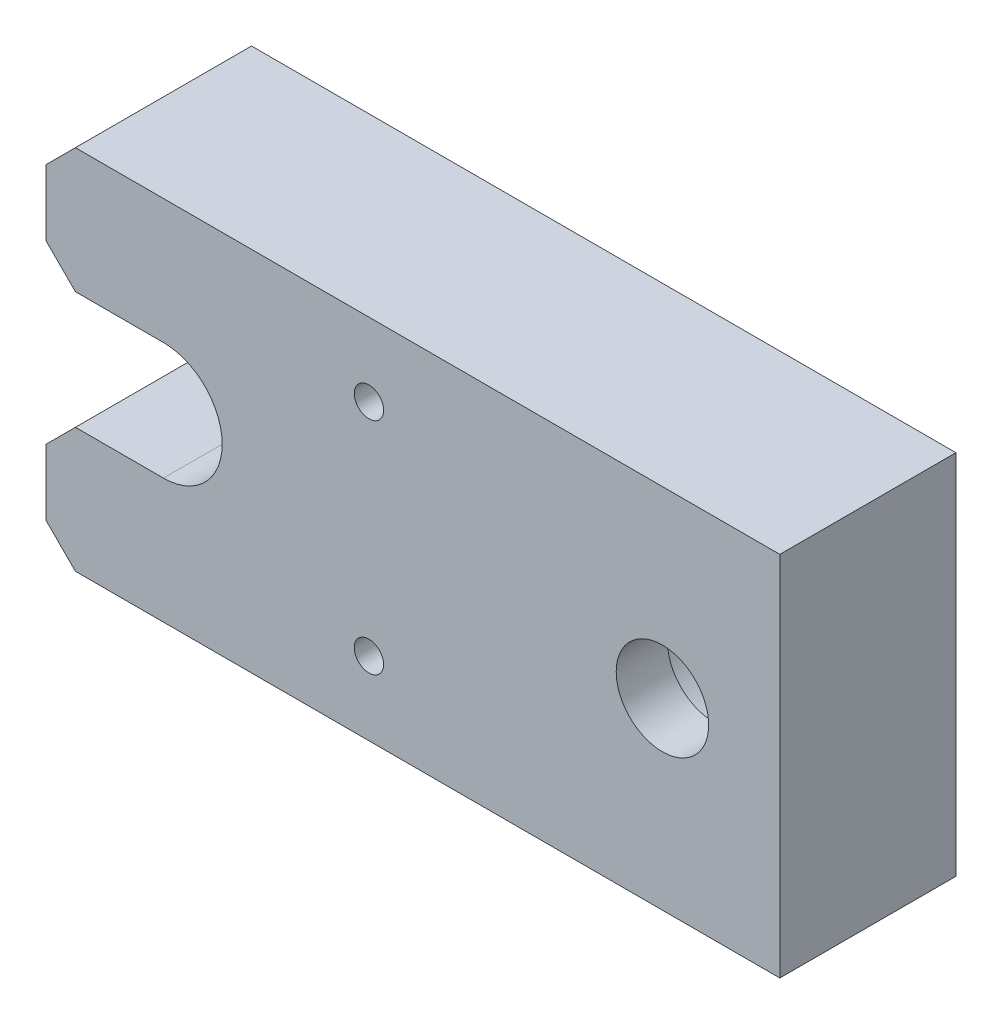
ISO-10303-21;
HEADER;
FILE_DESCRIPTION(('STEP AP214'),'2;1');
FILE_NAME('part.step','',(''),(''),'','','');
FILE_SCHEMA(('AUTOMOTIVE_DESIGN { 1 0 10303 214 1 1 1 1 }'));
ENDSEC;
DATA;
#1=APPLICATION_CONTEXT('core data for automotive mechanical design processes');
#2=APPLICATION_PROTOCOL_DEFINITION('international standard','automotive_design',2000,#1);
#3=PRODUCT_CONTEXT('',#1,'mechanical');
#4=PRODUCT('Part','Part','',(#3));
#5=PRODUCT_RELATED_PRODUCT_CATEGORY('part','',(#4));
#6=PRODUCT_DEFINITION_FORMATION('','',#4);
#7=PRODUCT_DEFINITION_CONTEXT('part definition',#1,'design');
#8=PRODUCT_DEFINITION('design','',#6,#7);
#9=PRODUCT_DEFINITION_SHAPE('','',#8);
#10=(LENGTH_UNIT() NAMED_UNIT(*) SI_UNIT(.MILLI.,.METRE.));
#11=(NAMED_UNIT(*) PLANE_ANGLE_UNIT() SI_UNIT($,.RADIAN.));
#12=(NAMED_UNIT(*) SI_UNIT($,.STERADIAN.) SOLID_ANGLE_UNIT());
#13=UNCERTAINTY_MEASURE_WITH_UNIT(LENGTH_MEASURE(1.E-05),#10,'distance_accuracy_value','');
#14=(GEOMETRIC_REPRESENTATION_CONTEXT(3) GLOBAL_UNCERTAINTY_ASSIGNED_CONTEXT((#13)) GLOBAL_UNIT_ASSIGNED_CONTEXT((#10,
#11,#12)) REPRESENTATION_CONTEXT('',''));
#15=CARTESIAN_POINT('',(0.,0.,0.));
#16=DIRECTION('',(0.,0.,1.));
#17=DIRECTION('',(1.,0.,0.));
#18=AXIS2_PLACEMENT_3D('',#15,#16,#17);
#19=CARTESIAN_POINT('',(-6.00000000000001,12.5,0.));
#20=DIRECTION('',(0.,0.,1.));
#21=DIRECTION('',(1.,0.,0.));
#22=AXIS2_PLACEMENT_3D('',#19,#20,#21);
#23=PLANE('',#22);
#24=CARTESIAN_POINT('',(8.,5.,0.));
#25=DIRECTION('',(0.,0.,1.));
#26=DIRECTION('',(1.,0.,0.));
#27=AXIS2_PLACEMENT_3D('',#24,#25,#26);
#28=CIRCLE('',#27,2.5);
#29=CARTESIAN_POINT('',(5.5,5.,0.));
#30=VERTEX_POINT('',#29);
#31=EDGE_CURVE('E236',#30,#30,#28,.T.);
#32=ORIENTED_EDGE('',*,*,#31,.T.);
#33=EDGE_LOOP('',(#32));
#34=FACE_BOUND('',#33,.T.);
#35=DIRECTION('',(0.,-1.,0.));
#36=VECTOR('',#35,1.);
#37=CARTESIAN_POINT('',(-14.,0.,0.));
#38=LINE('',#37,#36);
#39=CARTESIAN_POINT('',(-14.,6.5,0.));
#40=VERTEX_POINT('',#39);
#41=CARTESIAN_POINT('',(-14.,2.00000000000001,0.));
#42=VERTEX_POINT('',#41);
#43=EDGE_CURVE('E139',#40,#42,#38,.T.);
#44=ORIENTED_EDGE('',*,*,#43,.F.);
#45=DIRECTION('',(-0.707106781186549,-0.707106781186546,0.));
#46=VECTOR('',#45,1.);
#47=CARTESIAN_POINT('',(-14.,6.5,0.));
#48=LINE('',#47,#46);
#49=CARTESIAN_POINT('',(-12.,8.5,0.));
#50=VERTEX_POINT('',#49);
#51=EDGE_CURVE('E205',#40,#50,#48,.F.);
#52=ORIENTED_EDGE('',*,*,#51,.T.);
#53=DIRECTION('',(-1.,0.,0.));
#54=VECTOR('',#53,1.);
#55=CARTESIAN_POINT('',(-14.,8.5,0.));
#56=LINE('',#55,#54);
#57=CARTESIAN_POINT('',(-6.00000000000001,8.5,0.));
#58=VERTEX_POINT('',#57);
#59=EDGE_CURVE('E184',#58,#50,#56,.T.);
#60=ORIENTED_EDGE('',*,*,#59,.F.);
#61=CARTESIAN_POINT('',(-6.00000000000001,12.5,0.));
#62=DIRECTION('',(0.,0.,-1.));
#63=DIRECTION('',(1.,0.,0.));
#64=AXIS2_PLACEMENT_3D('',#61,#62,#63);
#65=CIRCLE('',#64,4.);
#66=CARTESIAN_POINT('',(-6.00000000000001,16.5,0.));
#67=VERTEX_POINT('',#66);
#68=EDGE_CURVE('E182',#67,#58,#65,.T.);
#69=ORIENTED_EDGE('',*,*,#68,.F.);
#70=DIRECTION('',(1.,0.,0.));
#71=VECTOR('',#70,1.);
#72=CARTESIAN_POINT('',(-14.,16.5,0.));
#73=LINE('',#72,#71);
#74=CARTESIAN_POINT('',(-12.,16.5,0.));
#75=VERTEX_POINT('',#74);
#76=EDGE_CURVE('E180',#75,#67,#73,.T.);
#77=ORIENTED_EDGE('',*,*,#76,.F.);
#78=DIRECTION('',(0.707106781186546,-0.707106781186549,0.));
#79=VECTOR('',#78,1.);
#80=CARTESIAN_POINT('',(-12.,16.5,0.));
#81=LINE('',#80,#79);
#82=CARTESIAN_POINT('',(-14.,18.5,0.));
#83=VERTEX_POINT('',#82);
#84=EDGE_CURVE('E203',#75,#83,#81,.F.);
#85=ORIENTED_EDGE('',*,*,#84,.T.);
#86=DIRECTION('',(0.,-1.,0.));
#87=VECTOR('',#86,1.);
#88=CARTESIAN_POINT('',(-14.,16.5,0.));
#89=LINE('',#88,#87);
#90=CARTESIAN_POINT('',(-14.,23.,0.));
#91=VERTEX_POINT('',#90);
#92=EDGE_CURVE('E178',#91,#83,#89,.T.);
#93=ORIENTED_EDGE('',*,*,#92,.F.);
#94=DIRECTION('',(-0.707106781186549,-0.707106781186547,0.));
#95=VECTOR('',#94,1.);
#96=CARTESIAN_POINT('',(-14.,23.,0.));
#97=LINE('',#96,#95);
#98=CARTESIAN_POINT('',(-12.,25.,0.));
#99=VERTEX_POINT('',#98);
#100=EDGE_CURVE('E199',#91,#99,#97,.F.);
#101=ORIENTED_EDGE('',*,*,#100,.T.);
#102=DIRECTION('',(-1.,0.,0.));
#103=VECTOR('',#102,1.);
#104=CARTESIAN_POINT('',(0.,25.,0.));
#105=LINE('',#104,#103);
#106=CARTESIAN_POINT('',(36.,25.,0.));
#107=VERTEX_POINT('',#106);
#108=EDGE_CURVE('E175',#107,#99,#105,.T.);
#109=ORIENTED_EDGE('',*,*,#108,.F.);
#110=DIRECTION('',(0.,1.,0.));
#111=VECTOR('',#110,1.);
#112=CARTESIAN_POINT('',(36.,0.,0.));
#113=LINE('',#112,#111);
#114=CARTESIAN_POINT('',(36.,0.,0.));
#115=VERTEX_POINT('',#114);
#116=EDGE_CURVE('E172',#115,#107,#113,.T.);
#117=ORIENTED_EDGE('',*,*,#116,.F.);
#118=DIRECTION('',(1.,0.,0.));
#119=VECTOR('',#118,1.);
#120=CARTESIAN_POINT('',(0.,0.,0.));
#121=LINE('',#120,#119);
#122=CARTESIAN_POINT('',(-12.,0.,0.));
#123=VERTEX_POINT('',#122);
#124=EDGE_CURVE('E145',#123,#115,#121,.T.);
#125=ORIENTED_EDGE('',*,*,#124,.F.);
#126=DIRECTION('',(0.707106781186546,-0.707106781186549,0.));
#127=VECTOR('',#126,1.);
#128=CARTESIAN_POINT('',(-12.,0.,0.));
#129=LINE('',#128,#127);
#130=EDGE_CURVE('E201',#123,#42,#129,.F.);
#131=ORIENTED_EDGE('',*,*,#130,.T.);
#132=EDGE_LOOP('',(#44,#52,#60,#69,#77,#85,#93,#101,#109,#117,#125,#131));
#133=FACE_BOUND('',#132,.T.);
#134=CARTESIAN_POINT('',(8.,20.,0.));
#135=DIRECTION('',(0.,0.,1.));
#136=DIRECTION('',(1.,0.,0.));
#137=AXIS2_PLACEMENT_3D('',#134,#135,#136);
#138=CIRCLE('',#137,2.5);
#139=CARTESIAN_POINT('',(5.5,20.,0.));
#140=VERTEX_POINT('',#139);
#141=EDGE_CURVE('E229',#140,#140,#138,.T.);
#142=ORIENTED_EDGE('',*,*,#141,.T.);
#143=EDGE_LOOP('',(#142));
#144=FACE_BOUND('',#143,.T.);
#145=CARTESIAN_POINT('',(28.,12.5,0.));
#146=DIRECTION('',(0.,0.,1.));
#147=DIRECTION('',(1.,0.,0.));
#148=AXIS2_PLACEMENT_3D('',#145,#146,#147);
#149=CIRCLE('',#148,5.5);
#150=CARTESIAN_POINT('',(22.5,12.5,0.));
#151=VERTEX_POINT('',#150);
#152=EDGE_CURVE('E243',#151,#151,#149,.T.);
#153=ORIENTED_EDGE('',*,*,#152,.T.);
#154=EDGE_LOOP('',(#153));
#155=FACE_BOUND('',#154,.T.);
#156=ADVANCED_FACE('F34',(#34,#133,#144,#155),#23,.F.);
#157=CARTESIAN_POINT('',(-6.00000000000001,12.5,12.));
#158=DIRECTION('',(0.,0.,1.));
#159=DIRECTION('',(1.,0.,0.));
#160=AXIS2_PLACEMENT_3D('',#157,#158,#159);
#161=PLANE('',#160);
#162=CARTESIAN_POINT('',(8.,5.,12.));
#163=DIRECTION('',(0.,0.,1.));
#164=DIRECTION('',(1.,0.,0.));
#165=AXIS2_PLACEMENT_3D('',#162,#163,#164);
#166=CIRCLE('',#165,1.);
#167=CARTESIAN_POINT('',(7.,5.,12.));
#168=VERTEX_POINT('',#167);
#169=EDGE_CURVE('E250',#168,#168,#166,.T.);
#170=ORIENTED_EDGE('',*,*,#169,.F.);
#171=EDGE_LOOP('',(#170));
#172=FACE_BOUND('',#171,.T.);
#173=DIRECTION('',(-1.,0.,0.));
#174=VECTOR('',#173,1.);
#175=CARTESIAN_POINT('',(-14.,8.5,12.));
#176=LINE('',#175,#174);
#177=CARTESIAN_POINT('',(-6.00000000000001,8.5,12.));
#178=VERTEX_POINT('',#177);
#179=CARTESIAN_POINT('',(-12.,8.5,12.));
#180=VERTEX_POINT('',#179);
#181=EDGE_CURVE('E166',#178,#180,#176,.T.);
#182=ORIENTED_EDGE('',*,*,#181,.T.);
#183=DIRECTION('',(0.707106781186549,0.707106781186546,0.));
#184=VECTOR('',#183,1.);
#185=CARTESIAN_POINT('',(-7.,13.5,12.));
#186=LINE('',#185,#184);
#187=CARTESIAN_POINT('',(-14.,6.5,12.));
#188=VERTEX_POINT('',#187);
#189=EDGE_CURVE('E213',#180,#188,#186,.F.);
#190=ORIENTED_EDGE('',*,*,#189,.T.);
#191=DIRECTION('',(0.,-1.,0.));
#192=VECTOR('',#191,1.);
#193=CARTESIAN_POINT('',(-14.,0.,12.));
#194=LINE('',#193,#192);
#195=CARTESIAN_POINT('',(-14.,2.00000000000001,12.));
#196=VERTEX_POINT('',#195);
#197=EDGE_CURVE('E168',#188,#196,#194,.T.);
#198=ORIENTED_EDGE('',*,*,#197,.T.);
#199=DIRECTION('',(-0.707106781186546,0.707106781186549,0.));
#200=VECTOR('',#199,1.);
#201=CARTESIAN_POINT('',(-15.25,3.25000000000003,12.));
#202=LINE('',#201,#200);
#203=CARTESIAN_POINT('',(-12.,0.,12.));
#204=VERTEX_POINT('',#203);
#205=EDGE_CURVE('E135',#196,#204,#202,.F.);
#206=ORIENTED_EDGE('',*,*,#205,.T.);
#207=DIRECTION('',(1.,0.,0.));
#208=VECTOR('',#207,1.);
#209=CARTESIAN_POINT('',(0.,0.,12.));
#210=LINE('',#209,#208);
#211=CARTESIAN_POINT('',(36.,0.,12.));
#212=VERTEX_POINT('',#211);
#213=EDGE_CURVE('E124',#204,#212,#210,.T.);
#214=ORIENTED_EDGE('',*,*,#213,.T.);
#215=DIRECTION('',(0.,1.,0.));
#216=VECTOR('',#215,1.);
#217=CARTESIAN_POINT('',(36.,0.,12.));
#218=LINE('',#217,#216);
#219=CARTESIAN_POINT('',(36.,25.,12.));
#220=VERTEX_POINT('',#219);
#221=EDGE_CURVE('E131',#212,#220,#218,.T.);
#222=ORIENTED_EDGE('',*,*,#221,.T.);
#223=DIRECTION('',(-1.,0.,0.));
#224=VECTOR('',#223,1.);
#225=CARTESIAN_POINT('',(0.,25.,12.));
#226=LINE('',#225,#224);
#227=CARTESIAN_POINT('',(-12.,25.,12.));
#228=VERTEX_POINT('',#227);
#229=EDGE_CURVE('E155',#220,#228,#226,.T.);
#230=ORIENTED_EDGE('',*,*,#229,.T.);
#231=DIRECTION('',(0.707106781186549,0.707106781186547,0.));
#232=VECTOR('',#231,1.);
#233=CARTESIAN_POINT('',(-15.25,21.75,12.));
#234=LINE('',#233,#232);
#235=CARTESIAN_POINT('',(-14.,23.,12.));
#236=VERTEX_POINT('',#235);
#237=EDGE_CURVE('E209',#228,#236,#234,.F.);
#238=ORIENTED_EDGE('',*,*,#237,.T.);
#239=DIRECTION('',(0.,-1.,0.));
#240=VECTOR('',#239,1.);
#241=CARTESIAN_POINT('',(-14.,16.5,12.));
#242=LINE('',#241,#240);
#243=CARTESIAN_POINT('',(-14.,18.5,12.));
#244=VERTEX_POINT('',#243);
#245=EDGE_CURVE('E157',#236,#244,#242,.T.);
#246=ORIENTED_EDGE('',*,*,#245,.T.);
#247=DIRECTION('',(-0.707106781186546,0.707106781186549,0.));
#248=VECTOR('',#247,1.);
#249=CARTESIAN_POINT('',(-7.00000000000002,11.5,12.));
#250=LINE('',#249,#248);
#251=CARTESIAN_POINT('',(-12.,16.5,12.));
#252=VERTEX_POINT('',#251);
#253=EDGE_CURVE('E51',#244,#252,#250,.F.);
#254=ORIENTED_EDGE('',*,*,#253,.T.);
#255=DIRECTION('',(1.,0.,0.));
#256=VECTOR('',#255,1.);
#257=CARTESIAN_POINT('',(-14.,16.5,12.));
#258=LINE('',#257,#256);
#259=CARTESIAN_POINT('',(-6.00000000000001,16.5,12.));
#260=VERTEX_POINT('',#259);
#261=EDGE_CURVE('E162',#252,#260,#258,.T.);
#262=ORIENTED_EDGE('',*,*,#261,.T.);
#263=CARTESIAN_POINT('',(-6.00000000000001,12.5,12.));
#264=DIRECTION('',(0.,0.,-1.));
#265=DIRECTION('',(1.,0.,0.));
#266=AXIS2_PLACEMENT_3D('',#263,#264,#265);
#267=CIRCLE('',#266,4.);
#268=EDGE_CURVE('E164',#260,#178,#267,.T.);
#269=ORIENTED_EDGE('',*,*,#268,.T.);
#270=EDGE_LOOP('',(#182,#190,#198,#206,#214,#222,#230,#238,#246,#254,#262,#269));
#271=FACE_BOUND('',#270,.T.);
#272=CARTESIAN_POINT('',(8.,20.,12.));
#273=DIRECTION('',(0.,0.,1.));
#274=DIRECTION('',(1.,0.,0.));
#275=AXIS2_PLACEMENT_3D('',#272,#273,#274);
#276=CIRCLE('',#275,1.);
#277=CARTESIAN_POINT('',(7.,20.,12.));
#278=VERTEX_POINT('',#277);
#279=EDGE_CURVE('E173',#278,#278,#276,.T.);
#280=ORIENTED_EDGE('',*,*,#279,.F.);
#281=EDGE_LOOP('',(#280));
#282=FACE_BOUND('',#281,.T.);
#283=CARTESIAN_POINT('',(28.,12.5,12.));
#284=DIRECTION('',(0.,0.,1.));
#285=DIRECTION('',(1.,0.,0.));
#286=AXIS2_PLACEMENT_3D('',#283,#284,#285);
#287=CIRCLE('',#286,3.15);
#288=CARTESIAN_POINT('',(24.85,12.5,12.));
#289=VERTEX_POINT('',#288);
#290=EDGE_CURVE('E225',#289,#289,#287,.T.);
#291=ORIENTED_EDGE('',*,*,#290,.F.);
#292=EDGE_LOOP('',(#291));
#293=FACE_BOUND('',#292,.T.);
#294=ADVANCED_FACE('F127',(#172,#271,#282,#293),#161,.T.);
#295=CARTESIAN_POINT('',(0.,0.,12.));
#296=DIRECTION('',(0.,1.,0.));
#297=DIRECTION('',(0.,0.,1.));
#298=AXIS2_PLACEMENT_3D('',#295,#296,#297);
#299=PLANE('',#298);
#300=ORIENTED_EDGE('',*,*,#213,.F.);
#301=DIRECTION('',(0.,0.,-1.));
#302=VECTOR('',#301,1.);
#303=CARTESIAN_POINT('',(-12.,0.,12.));
#304=LINE('',#303,#302);
#305=EDGE_CURVE('E43',#204,#123,#304,.T.);
#306=ORIENTED_EDGE('',*,*,#305,.T.);
#307=ORIENTED_EDGE('',*,*,#124,.T.);
#308=DIRECTION('',(0.,0.,-1.));
#309=VECTOR('',#308,1.);
#310=CARTESIAN_POINT('',(36.,0.,12.));
#311=LINE('',#310,#309);
#312=EDGE_CURVE('E142',#212,#115,#311,.T.);
#313=ORIENTED_EDGE('',*,*,#312,.F.);
#314=EDGE_LOOP('',(#300,#306,#307,#313));
#315=FACE_BOUND('',#314,.T.);
#316=ADVANCED_FACE('F143',(#315),#299,.F.);
#317=CARTESIAN_POINT('',(36.,0.,12.));
#318=DIRECTION('',(-1.,0.,0.));
#319=DIRECTION('',(0.,0.,1.));
#320=AXIS2_PLACEMENT_3D('',#317,#318,#319);
#321=PLANE('',#320);
#322=ORIENTED_EDGE('',*,*,#116,.T.);
#323=DIRECTION('',(0.,0.,-1.));
#324=VECTOR('',#323,1.);
#325=CARTESIAN_POINT('',(36.,25.,12.));
#326=LINE('',#325,#324);
#327=EDGE_CURVE('E150',#220,#107,#326,.T.);
#328=ORIENTED_EDGE('',*,*,#327,.F.);
#329=ORIENTED_EDGE('',*,*,#221,.F.);
#330=ORIENTED_EDGE('',*,*,#312,.T.);
#331=EDGE_LOOP('',(#322,#328,#329,#330));
#332=FACE_BOUND('',#331,.T.);
#333=ADVANCED_FACE('F152',(#332),#321,.F.);
#334=CARTESIAN_POINT('',(0.,25.,12.));
#335=DIRECTION('',(0.,-1.,0.));
#336=DIRECTION('',(1.,0.,0.));
#337=AXIS2_PLACEMENT_3D('',#334,#335,#336);
#338=PLANE('',#337);
#339=ORIENTED_EDGE('',*,*,#108,.T.);
#340=DIRECTION('',(0.,0.,1.));
#341=VECTOR('',#340,1.);
#342=CARTESIAN_POINT('',(-12.,25.,12.));
#343=LINE('',#342,#341);
#344=EDGE_CURVE('E11',#99,#228,#343,.T.);
#345=ORIENTED_EDGE('',*,*,#344,.T.);
#346=ORIENTED_EDGE('',*,*,#229,.F.);
#347=ORIENTED_EDGE('',*,*,#327,.T.);
#348=EDGE_LOOP('',(#339,#345,#346,#347));
#349=FACE_BOUND('',#348,.T.);
#350=ADVANCED_FACE('F306',(#349),#338,.F.);
#351=CARTESIAN_POINT('',(-14.,16.5,12.));
#352=DIRECTION('',(1.,0.,0.));
#353=DIRECTION('',(0.,0.,-1.));
#354=AXIS2_PLACEMENT_3D('',#351,#352,#353);
#355=PLANE('',#354);
#356=ORIENTED_EDGE('',*,*,#92,.T.);
#357=DIRECTION('',(0.,0.,1.));
#358=VECTOR('',#357,1.);
#359=CARTESIAN_POINT('',(-14.,18.5,12.));
#360=LINE('',#359,#358);
#361=EDGE_CURVE('E59',#83,#244,#360,.T.);
#362=ORIENTED_EDGE('',*,*,#361,.T.);
#363=ORIENTED_EDGE('',*,*,#245,.F.);
#364=DIRECTION('',(0.,0.,-1.));
#365=VECTOR('',#364,1.);
#366=CARTESIAN_POINT('',(-14.,23.,12.));
#367=LINE('',#366,#365);
#368=EDGE_CURVE('E218',#236,#91,#367,.T.);
#369=ORIENTED_EDGE('',*,*,#368,.T.);
#370=EDGE_LOOP('',(#356,#362,#363,#369));
#371=FACE_BOUND('',#370,.T.);
#372=ADVANCED_FACE('F302',(#371),#355,.F.);
#373=CARTESIAN_POINT('',(-14.,16.5,12.));
#374=DIRECTION('',(0.,1.,0.));
#375=DIRECTION('',(0.,0.,1.));
#376=AXIS2_PLACEMENT_3D('',#373,#374,#375);
#377=PLANE('',#376);
#378=ORIENTED_EDGE('',*,*,#261,.F.);
#379=DIRECTION('',(0.,0.,-1.));
#380=VECTOR('',#379,1.);
#381=CARTESIAN_POINT('',(-12.,16.5,12.));
#382=LINE('',#381,#380);
#383=EDGE_CURVE('E215',#252,#75,#382,.T.);
#384=ORIENTED_EDGE('',*,*,#383,.T.);
#385=ORIENTED_EDGE('',*,*,#76,.T.);
#386=DIRECTION('',(0.,0.,-1.));
#387=VECTOR('',#386,1.);
#388=CARTESIAN_POINT('',(-6.00000000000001,16.5,12.));
#389=LINE('',#388,#387);
#390=EDGE_CURVE('E191',#260,#67,#389,.T.);
#391=ORIENTED_EDGE('',*,*,#390,.F.);
#392=EDGE_LOOP('',(#378,#384,#385,#391));
#393=FACE_BOUND('',#392,.T.);
#394=ADVANCED_FACE('F298',(#393),#377,.F.);
#395=CARTESIAN_POINT('',(-6.00000000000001,12.5,12.));
#396=DIRECTION('',(0.,0.,-1.));
#397=DIRECTION('',(-1.,0.,0.));
#398=AXIS2_PLACEMENT_3D('',#395,#396,#397);
#399=CYLINDRICAL_SURFACE('',#398,4.);
#400=ORIENTED_EDGE('',*,*,#68,.T.);
#401=DIRECTION('',(0.,0.,-1.));
#402=VECTOR('',#401,1.);
#403=CARTESIAN_POINT('',(-6.00000000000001,8.5,12.));
#404=LINE('',#403,#402);
#405=EDGE_CURVE('E170',#178,#58,#404,.T.);
#406=ORIENTED_EDGE('',*,*,#405,.F.);
#407=ORIENTED_EDGE('',*,*,#268,.F.);
#408=ORIENTED_EDGE('',*,*,#390,.T.);
#409=EDGE_LOOP('',(#400,#406,#407,#408));
#410=FACE_BOUND('',#409,.T.);
#411=ADVANCED_FACE('F294',(#410),#399,.F.);
#412=CARTESIAN_POINT('',(-14.,8.5,12.));
#413=DIRECTION('',(0.,-1.,0.));
#414=DIRECTION('',(0.,0.,-1.));
#415=AXIS2_PLACEMENT_3D('',#412,#413,#414);
#416=PLANE('',#415);
#417=ORIENTED_EDGE('',*,*,#59,.T.);
#418=DIRECTION('',(0.,0.,1.));
#419=VECTOR('',#418,1.);
#420=CARTESIAN_POINT('',(-12.,8.5,12.));
#421=LINE('',#420,#419);
#422=EDGE_CURVE('E207',#50,#180,#421,.T.);
#423=ORIENTED_EDGE('',*,*,#422,.T.);
#424=ORIENTED_EDGE('',*,*,#181,.F.);
#425=ORIENTED_EDGE('',*,*,#405,.T.);
#426=EDGE_LOOP('',(#417,#423,#424,#425));
#427=FACE_BOUND('',#426,.T.);
#428=ADVANCED_FACE('F290',(#427),#416,.F.);
#429=CARTESIAN_POINT('',(-14.,0.,12.));
#430=DIRECTION('',(1.,0.,0.));
#431=DIRECTION('',(0.,0.,-1.));
#432=AXIS2_PLACEMENT_3D('',#429,#430,#431);
#433=PLANE('',#432);
#434=ORIENTED_EDGE('',*,*,#197,.F.);
#435=DIRECTION('',(0.,0.,-1.));
#436=VECTOR('',#435,1.);
#437=CARTESIAN_POINT('',(-14.,6.5,12.));
#438=LINE('',#437,#436);
#439=EDGE_CURVE('E196',#188,#40,#438,.T.);
#440=ORIENTED_EDGE('',*,*,#439,.T.);
#441=ORIENTED_EDGE('',*,*,#43,.T.);
#442=DIRECTION('',(0.,0.,1.));
#443=VECTOR('',#442,1.);
#444=CARTESIAN_POINT('',(-14.,2.00000000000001,12.));
#445=LINE('',#444,#443);
#446=EDGE_CURVE('E149',#42,#196,#445,.T.);
#447=ORIENTED_EDGE('',*,*,#446,.T.);
#448=EDGE_LOOP('',(#434,#440,#441,#447));
#449=FACE_BOUND('',#448,.T.);
#450=ADVANCED_FACE('F287',(#449),#433,.F.);
#451=CARTESIAN_POINT('',(8.,20.,12.));
#452=DIRECTION('',(0.,0.,-1.));
#453=DIRECTION('',(-1.,0.,0.));
#454=AXIS2_PLACEMENT_3D('',#451,#452,#453);
#455=CYLINDRICAL_SURFACE('',#454,1.);
#456=CARTESIAN_POINT('',(8.,20.,8.5));
#457=DIRECTION('',(0.,0.,1.));
#458=DIRECTION('',(1.,0.,0.));
#459=AXIS2_PLACEMENT_3D('',#456,#457,#458);
#460=CIRCLE('',#459,1.);
#461=CARTESIAN_POINT('',(7.,20.,8.5));
#462=VERTEX_POINT('',#461);
#463=EDGE_CURVE('E223',#462,#462,#460,.T.);
#464=CARTESIAN_POINT('',(7.,20.,8.5));
#465=CARTESIAN_POINT('',(7.,20.,8.53645833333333));
#466=CARTESIAN_POINT('',(7.,20.,8.57291666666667));
#467=CARTESIAN_POINT('',(7.,20.,8.64583333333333));
#468=CARTESIAN_POINT('',(7.,20.,8.68229166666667));
#469=CARTESIAN_POINT('',(7.,20.,8.75520833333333));
#470=CARTESIAN_POINT('',(7.,20.,8.79166666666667));
#471=CARTESIAN_POINT('',(7.,20.,8.86458333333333));
#472=CARTESIAN_POINT('',(7.,20.,8.90104166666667));
#473=CARTESIAN_POINT('',(7.,20.,8.97395833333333));
#474=CARTESIAN_POINT('',(7.,20.,9.01041666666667));
#475=CARTESIAN_POINT('',(7.,20.,9.08333333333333));
#476=CARTESIAN_POINT('',(7.,20.,9.11979166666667));
#477=CARTESIAN_POINT('',(7.,20.,9.19270833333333));
#478=CARTESIAN_POINT('',(7.,20.,9.22916666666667));
#479=CARTESIAN_POINT('',(7.,20.,9.30208333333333));
#480=CARTESIAN_POINT('',(7.,20.,9.33854166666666));
#481=CARTESIAN_POINT('',(7.,20.,9.41145833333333));
#482=CARTESIAN_POINT('',(7.,20.,9.44791666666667));
#483=CARTESIAN_POINT('',(7.,20.,9.52083333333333));
#484=CARTESIAN_POINT('',(7.,20.,9.55729166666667));
#485=CARTESIAN_POINT('',(7.,20.,9.63020833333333));
#486=CARTESIAN_POINT('',(7.,20.,9.66666666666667));
#487=CARTESIAN_POINT('',(7.,20.,9.73958333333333));
#488=CARTESIAN_POINT('',(7.,20.,9.77604166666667));
#489=CARTESIAN_POINT('',(7.,20.,9.84895833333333));
#490=CARTESIAN_POINT('',(7.,20.,9.88541666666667));
#491=CARTESIAN_POINT('',(7.,20.,9.95833333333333));
#492=CARTESIAN_POINT('',(7.,20.,9.99479166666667));
#493=CARTESIAN_POINT('',(7.,20.,10.0677083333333));
#494=CARTESIAN_POINT('',(7.,20.,10.1041666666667));
#495=CARTESIAN_POINT('',(7.,20.,10.1770833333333));
#496=CARTESIAN_POINT('',(7.,20.,10.2135416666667));
#497=CARTESIAN_POINT('',(7.,20.,10.2864583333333));
#498=CARTESIAN_POINT('',(7.,20.,10.3229166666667));
#499=CARTESIAN_POINT('',(7.,20.,10.3958333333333));
#500=CARTESIAN_POINT('',(7.,20.,10.4322916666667));
#501=CARTESIAN_POINT('',(7.,20.,10.5052083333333));
#502=CARTESIAN_POINT('',(7.,20.,10.5416666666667));
#503=CARTESIAN_POINT('',(7.,20.,10.6145833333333));
#504=CARTESIAN_POINT('',(7.,20.,10.6510416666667));
#505=CARTESIAN_POINT('',(7.,20.,10.7239583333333));
#506=CARTESIAN_POINT('',(7.,20.,10.7604166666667));
#507=CARTESIAN_POINT('',(7.,20.,10.8333333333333));
#508=CARTESIAN_POINT('',(7.,20.,10.8697916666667));
#509=CARTESIAN_POINT('',(7.,20.,10.9427083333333));
#510=CARTESIAN_POINT('',(7.,20.,10.9791666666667));
#511=CARTESIAN_POINT('',(7.,20.,11.0520833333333));
#512=CARTESIAN_POINT('',(7.,20.,11.0885416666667));
#513=CARTESIAN_POINT('',(7.,20.,11.1614583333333));
#514=CARTESIAN_POINT('',(7.,20.,11.1979166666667));
#515=CARTESIAN_POINT('',(7.,20.,11.2708333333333));
#516=CARTESIAN_POINT('',(7.,20.,11.3072916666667));
#517=CARTESIAN_POINT('',(7.,20.,11.3802083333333));
#518=CARTESIAN_POINT('',(7.,20.,11.4166666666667));
#519=CARTESIAN_POINT('',(7.,20.,11.4895833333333));
#520=CARTESIAN_POINT('',(7.,20.,11.5260416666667));
#521=CARTESIAN_POINT('',(7.,20.,11.5989583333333));
#522=CARTESIAN_POINT('',(7.,20.,11.6354166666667));
#523=CARTESIAN_POINT('',(7.,20.,11.7083333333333));
#524=CARTESIAN_POINT('',(7.,20.,11.7447916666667));
#525=CARTESIAN_POINT('',(7.,20.,11.8177083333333));
#526=CARTESIAN_POINT('',(7.,20.,11.8541666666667));
#527=CARTESIAN_POINT('',(7.,20.,11.9270833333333));
#528=CARTESIAN_POINT('',(7.,20.,11.9635416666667));
#529=CARTESIAN_POINT('',(7.,20.,12.));
#530=B_SPLINE_CURVE_WITH_KNOTS('',3,(#464,#465,#466,#467,#468,#469,#470,#471,#472,#473,#474,
#475,#476,#477,#478,#479,#480,#481,#482,#483,#484,#485,#486,#487,#488,#489,#490,#491,#492,#493,
#494,#495,#496,#497,#498,#499,#500,#501,#502,#503,#504,#505,#506,#507,#508,#509,#510,#511,#512,
#513,#514,#515,#516,#517,#518,#519,#520,#521,#522,#523,#524,#525,#526,#527,#528,#529),
.UNSPECIFIED.,.F.,.F.,(4,2,2,2,2,2,2,2,2,2,2,2,2,2,2,2,2,2,2,2,2,2,2,2,2,2,2,2,2,2,2,2,4),(0.,
0.109374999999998,0.218749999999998,0.328124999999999,0.437499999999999,0.546874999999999,
0.656249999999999,0.765624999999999,0.874999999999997,0.984374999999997,1.09375,1.203125,1.3125,
1.421875,1.53125,1.640625,1.75,1.859375,1.96875,2.078125,2.1875,2.296875,2.40625,2.515625,2.625,
2.734375,2.84375,2.953125,3.0625,3.171875,3.28125,3.390625,3.5),.UNSPECIFIED.);
#531=EDGE_CURVE('BSEAM255',#462,#278,#530,.T.);
#532=ORIENTED_EDGE('',*,*,#463,.F.);
#533=ORIENTED_EDGE('',*,*,#279,.T.);
#534=ORIENTED_EDGE('',*,*,#531,.T.);
#535=ORIENTED_EDGE('',*,*,#531,.F.);
#536=EDGE_LOOP('',(#532,#534,#533,#535));
#537=FACE_BOUND('',#536,.T.);
#538=ADVANCED_FACE('F255',(#537),#455,.F.);
#539=CARTESIAN_POINT('',(8.,5.,12.));
#540=DIRECTION('',(0.,0.,-1.));
#541=DIRECTION('',(-1.,0.,0.));
#542=AXIS2_PLACEMENT_3D('',#539,#540,#541);
#543=CYLINDRICAL_SURFACE('',#542,1.);
#544=CARTESIAN_POINT('',(8.,5.,8.5));
#545=DIRECTION('',(0.,0.,1.));
#546=DIRECTION('',(1.,0.,0.));
#547=AXIS2_PLACEMENT_3D('',#544,#545,#546);
#548=CIRCLE('',#547,1.);
#549=CARTESIAN_POINT('',(7.,5.,8.5));
#550=VERTEX_POINT('',#549);
#551=EDGE_CURVE('E227',#550,#550,#548,.T.);
#552=CARTESIAN_POINT('',(7.,5.,8.5));
#553=CARTESIAN_POINT('',(7.,5.,8.53645833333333));
#554=CARTESIAN_POINT('',(7.,5.,8.57291666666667));
#555=CARTESIAN_POINT('',(7.,5.,8.64583333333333));
#556=CARTESIAN_POINT('',(7.,5.,8.68229166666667));
#557=CARTESIAN_POINT('',(7.,5.,8.75520833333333));
#558=CARTESIAN_POINT('',(7.,5.,8.79166666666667));
#559=CARTESIAN_POINT('',(7.,5.,8.86458333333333));
#560=CARTESIAN_POINT('',(7.,5.,8.90104166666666));
#561=CARTESIAN_POINT('',(7.,5.,8.97395833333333));
#562=CARTESIAN_POINT('',(7.,5.,9.01041666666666));
#563=CARTESIAN_POINT('',(7.,5.,9.08333333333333));
#564=CARTESIAN_POINT('',(7.,5.,9.11979166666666));
#565=CARTESIAN_POINT('',(7.,5.,9.19270833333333));
#566=CARTESIAN_POINT('',(7.,5.,9.22916666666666));
#567=CARTESIAN_POINT('',(7.,5.,9.30208333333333));
#568=CARTESIAN_POINT('',(7.,5.,9.33854166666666));
#569=CARTESIAN_POINT('',(7.,5.,9.41145833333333));
#570=CARTESIAN_POINT('',(7.,5.,9.44791666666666));
#571=CARTESIAN_POINT('',(7.,5.,9.52083333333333));
#572=CARTESIAN_POINT('',(7.,5.,9.55729166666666));
#573=CARTESIAN_POINT('',(7.,5.,9.63020833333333));
#574=CARTESIAN_POINT('',(7.,5.,9.66666666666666));
#575=CARTESIAN_POINT('',(7.,5.,9.73958333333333));
#576=CARTESIAN_POINT('',(7.,5.,9.77604166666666));
#577=CARTESIAN_POINT('',(7.,5.,9.84895833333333));
#578=CARTESIAN_POINT('',(7.,5.,9.88541666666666));
#579=CARTESIAN_POINT('',(7.,5.,9.95833333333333));
#580=CARTESIAN_POINT('',(7.,5.,9.99479166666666));
#581=CARTESIAN_POINT('',(7.,5.,10.0677083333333));
#582=CARTESIAN_POINT('',(7.,5.,10.1041666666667));
#583=CARTESIAN_POINT('',(7.,5.,10.1770833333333));
#584=CARTESIAN_POINT('',(7.,5.,10.2135416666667));
#585=CARTESIAN_POINT('',(7.,5.,10.2864583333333));
#586=CARTESIAN_POINT('',(7.,5.,10.3229166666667));
#587=CARTESIAN_POINT('',(7.,5.,10.3958333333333));
#588=CARTESIAN_POINT('',(7.,5.,10.4322916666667));
#589=CARTESIAN_POINT('',(7.,5.,10.5052083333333));
#590=CARTESIAN_POINT('',(7.,5.,10.5416666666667));
#591=CARTESIAN_POINT('',(7.,5.,10.6145833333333));
#592=CARTESIAN_POINT('',(7.,5.,10.6510416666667));
#593=CARTESIAN_POINT('',(7.,5.,10.7239583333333));
#594=CARTESIAN_POINT('',(7.,5.,10.7604166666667));
#595=CARTESIAN_POINT('',(7.,5.,10.8333333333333));
#596=CARTESIAN_POINT('',(7.,5.,10.8697916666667));
#597=CARTESIAN_POINT('',(7.,5.,10.9427083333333));
#598=CARTESIAN_POINT('',(7.,5.,10.9791666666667));
#599=CARTESIAN_POINT('',(7.,5.,11.0520833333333));
#600=CARTESIAN_POINT('',(7.,5.,11.0885416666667));
#601=CARTESIAN_POINT('',(7.,5.,11.1614583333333));
#602=CARTESIAN_POINT('',(7.,5.,11.1979166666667));
#603=CARTESIAN_POINT('',(7.,5.,11.2708333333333));
#604=CARTESIAN_POINT('',(7.,5.,11.3072916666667));
#605=CARTESIAN_POINT('',(7.,5.,11.3802083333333));
#606=CARTESIAN_POINT('',(7.,5.,11.4166666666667));
#607=CARTESIAN_POINT('',(7.,5.,11.4895833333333));
#608=CARTESIAN_POINT('',(7.,5.,11.5260416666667));
#609=CARTESIAN_POINT('',(7.,5.,11.5989583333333));
#610=CARTESIAN_POINT('',(7.,5.,11.6354166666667));
#611=CARTESIAN_POINT('',(7.,5.,11.7083333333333));
#612=CARTESIAN_POINT('',(7.,5.,11.7447916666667));
#613=CARTESIAN_POINT('',(7.,5.,11.8177083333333));
#614=CARTESIAN_POINT('',(7.,5.,11.8541666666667));
#615=CARTESIAN_POINT('',(7.,5.,11.9270833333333));
#616=CARTESIAN_POINT('',(7.,5.,11.9635416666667));
#617=CARTESIAN_POINT('',(7.,5.,12.));
#618=B_SPLINE_CURVE_WITH_KNOTS('',3,(#552,#553,#554,#555,#556,#557,#558,#559,#560,#561,#562,
#563,#564,#565,#566,#567,#568,#569,#570,#571,#572,#573,#574,#575,#576,#577,#578,#579,#580,#581,
#582,#583,#584,#585,#586,#587,#588,#589,#590,#591,#592,#593,#594,#595,#596,#597,#598,#599,#600,
#601,#602,#603,#604,#605,#606,#607,#608,#609,#610,#611,#612,#613,#614,#615,#616,#617),
.UNSPECIFIED.,.F.,.F.,(4,2,2,2,2,2,2,2,2,2,2,2,2,2,2,2,2,2,2,2,2,2,2,2,2,2,2,2,2,2,2,2,4),(0.,
0.109374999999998,0.218749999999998,0.328124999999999,0.437499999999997,0.546874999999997,
0.656249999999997,0.765624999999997,0.874999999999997,0.984374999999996,1.09375,1.203125,
1.31249999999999,1.42187499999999,1.53124999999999,1.64062499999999,1.74999999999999,
1.85937499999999,1.96874999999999,2.07812499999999,2.18749999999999,2.29687499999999,
2.40624999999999,2.51562499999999,2.62499999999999,2.73437499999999,2.84374999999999,
2.95312499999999,3.06249999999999,3.17187499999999,3.28124999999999,3.39062499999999,
3.49999999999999),.UNSPECIFIED.);
#619=EDGE_CURVE('BSEAM265',#550,#168,#618,.T.);
#620=ORIENTED_EDGE('',*,*,#551,.F.);
#621=ORIENTED_EDGE('',*,*,#169,.T.);
#622=ORIENTED_EDGE('',*,*,#619,.T.);
#623=ORIENTED_EDGE('',*,*,#619,.F.);
#624=EDGE_LOOP('',(#620,#622,#621,#623));
#625=FACE_BOUND('',#624,.T.);
#626=ADVANCED_FACE('F265',(#625),#543,.F.);
#627=CARTESIAN_POINT('',(28.,12.5,12.));
#628=DIRECTION('',(0.,0.,-1.));
#629=DIRECTION('',(-1.,0.,0.));
#630=AXIS2_PLACEMENT_3D('',#627,#628,#629);
#631=CYLINDRICAL_SURFACE('',#630,3.15);
#632=CARTESIAN_POINT('',(28.,12.5,8.5));
#633=DIRECTION('',(0.,0.,1.));
#634=DIRECTION('',(1.,0.,0.));
#635=AXIS2_PLACEMENT_3D('',#632,#633,#634);
#636=CIRCLE('',#635,3.15);
#637=CARTESIAN_POINT('',(24.85,12.5,8.5));
#638=VERTEX_POINT('',#637);
#639=EDGE_CURVE('E38',#638,#638,#636,.T.);
#640=CARTESIAN_POINT('',(24.85,12.5,8.5));
#641=CARTESIAN_POINT('',(24.85,12.5,8.53645833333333));
#642=CARTESIAN_POINT('',(24.85,12.5,8.57291666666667));
#643=CARTESIAN_POINT('',(24.85,12.5,8.64583333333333));
#644=CARTESIAN_POINT('',(24.85,12.5,8.68229166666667));
#645=CARTESIAN_POINT('',(24.85,12.5,8.75520833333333));
#646=CARTESIAN_POINT('',(24.85,12.5,8.79166666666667));
#647=CARTESIAN_POINT('',(24.85,12.5,8.86458333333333));
#648=CARTESIAN_POINT('',(24.85,12.5,8.90104166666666));
#649=CARTESIAN_POINT('',(24.85,12.5,8.97395833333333));
#650=CARTESIAN_POINT('',(24.85,12.5,9.01041666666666));
#651=CARTESIAN_POINT('',(24.85,12.5,9.08333333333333));
#652=CARTESIAN_POINT('',(24.85,12.5,9.11979166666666));
#653=CARTESIAN_POINT('',(24.85,12.5,9.19270833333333));
#654=CARTESIAN_POINT('',(24.85,12.5,9.22916666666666));
#655=CARTESIAN_POINT('',(24.85,12.5,9.30208333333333));
#656=CARTESIAN_POINT('',(24.85,12.5,9.33854166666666));
#657=CARTESIAN_POINT('',(24.85,12.5,9.41145833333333));
#658=CARTESIAN_POINT('',(24.85,12.5,9.44791666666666));
#659=CARTESIAN_POINT('',(24.85,12.5,9.52083333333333));
#660=CARTESIAN_POINT('',(24.85,12.5,9.55729166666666));
#661=CARTESIAN_POINT('',(24.85,12.5,9.63020833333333));
#662=CARTESIAN_POINT('',(24.85,12.5,9.66666666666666));
#663=CARTESIAN_POINT('',(24.85,12.5,9.73958333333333));
#664=CARTESIAN_POINT('',(24.85,12.5,9.77604166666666));
#665=CARTESIAN_POINT('',(24.85,12.5,9.84895833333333));
#666=CARTESIAN_POINT('',(24.85,12.5,9.88541666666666));
#667=CARTESIAN_POINT('',(24.85,12.5,9.95833333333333));
#668=CARTESIAN_POINT('',(24.85,12.5,9.99479166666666));
#669=CARTESIAN_POINT('',(24.85,12.5,10.0677083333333));
#670=CARTESIAN_POINT('',(24.85,12.5,10.1041666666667));
#671=CARTESIAN_POINT('',(24.85,12.5,10.1770833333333));
#672=CARTESIAN_POINT('',(24.85,12.5,10.2135416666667));
#673=CARTESIAN_POINT('',(24.85,12.5,10.2864583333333));
#674=CARTESIAN_POINT('',(24.85,12.5,10.3229166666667));
#675=CARTESIAN_POINT('',(24.85,12.5,10.3958333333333));
#676=CARTESIAN_POINT('',(24.85,12.5,10.4322916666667));
#677=CARTESIAN_POINT('',(24.85,12.5,10.5052083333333));
#678=CARTESIAN_POINT('',(24.85,12.5,10.5416666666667));
#679=CARTESIAN_POINT('',(24.85,12.5,10.6145833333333));
#680=CARTESIAN_POINT('',(24.85,12.5,10.6510416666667));
#681=CARTESIAN_POINT('',(24.85,12.5,10.7239583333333));
#682=CARTESIAN_POINT('',(24.85,12.5,10.7604166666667));
#683=CARTESIAN_POINT('',(24.85,12.5,10.8333333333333));
#684=CARTESIAN_POINT('',(24.85,12.5,10.8697916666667));
#685=CARTESIAN_POINT('',(24.85,12.5,10.9427083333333));
#686=CARTESIAN_POINT('',(24.85,12.5,10.9791666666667));
#687=CARTESIAN_POINT('',(24.85,12.5,11.0520833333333));
#688=CARTESIAN_POINT('',(24.85,12.5,11.0885416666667));
#689=CARTESIAN_POINT('',(24.85,12.5,11.1614583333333));
#690=CARTESIAN_POINT('',(24.85,12.5,11.1979166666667));
#691=CARTESIAN_POINT('',(24.85,12.5,11.2708333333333));
#692=CARTESIAN_POINT('',(24.85,12.5,11.3072916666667));
#693=CARTESIAN_POINT('',(24.85,12.5,11.3802083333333));
#694=CARTESIAN_POINT('',(24.85,12.5,11.4166666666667));
#695=CARTESIAN_POINT('',(24.85,12.5,11.4895833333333));
#696=CARTESIAN_POINT('',(24.85,12.5,11.5260416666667));
#697=CARTESIAN_POINT('',(24.85,12.5,11.5989583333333));
#698=CARTESIAN_POINT('',(24.85,12.5,11.6354166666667));
#699=CARTESIAN_POINT('',(24.85,12.5,11.7083333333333));
#700=CARTESIAN_POINT('',(24.85,12.5,11.7447916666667));
#701=CARTESIAN_POINT('',(24.85,12.5,11.8177083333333));
#702=CARTESIAN_POINT('',(24.85,12.5,11.8541666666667));
#703=CARTESIAN_POINT('',(24.85,12.5,11.9270833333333));
#704=CARTESIAN_POINT('',(24.85,12.5,11.9635416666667));
#705=CARTESIAN_POINT('',(24.85,12.5,12.));
#706=B_SPLINE_CURVE_WITH_KNOTS('',3,(#640,#641,#642,#643,#644,#645,#646,#647,#648,#649,#650,
#651,#652,#653,#654,#655,#656,#657,#658,#659,#660,#661,#662,#663,#664,#665,#666,#667,#668,#669,
#670,#671,#672,#673,#674,#675,#676,#677,#678,#679,#680,#681,#682,#683,#684,#685,#686,#687,#688,
#689,#690,#691,#692,#693,#694,#695,#696,#697,#698,#699,#700,#701,#702,#703,#704,#705),
.UNSPECIFIED.,.F.,.F.,(4,2,2,2,2,2,2,2,2,2,2,2,2,2,2,2,2,2,2,2,2,2,2,2,2,2,2,2,2,2,2,2,4),(0.,
0.109374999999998,0.218749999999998,0.328124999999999,0.437499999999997,0.546874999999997,
0.656249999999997,0.765624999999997,0.874999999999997,0.984374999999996,1.09375,1.203125,
1.31249999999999,1.42187499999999,1.53124999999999,1.64062499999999,1.74999999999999,
1.85937499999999,1.96874999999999,2.07812499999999,2.18749999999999,2.29687499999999,
2.40624999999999,2.51562499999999,2.62499999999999,2.73437499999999,2.84374999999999,
2.95312499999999,3.06249999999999,3.17187499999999,3.28124999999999,3.39062499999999,
3.49999999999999),.UNSPECIFIED.);
#707=EDGE_CURVE('BSEAM262',#638,#289,#706,.T.);
#708=ORIENTED_EDGE('',*,*,#639,.F.);
#709=ORIENTED_EDGE('',*,*,#290,.T.);
#710=ORIENTED_EDGE('',*,*,#707,.T.);
#711=ORIENTED_EDGE('',*,*,#707,.F.);
#712=EDGE_LOOP('',(#708,#710,#709,#711));
#713=FACE_BOUND('',#712,.T.);
#714=ADVANCED_FACE('F262',(#713),#631,.F.);
#715=CARTESIAN_POINT('',(-14.,6.5,12.));
#716=DIRECTION('',(0.707106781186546,-0.707106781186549,0.));
#717=DIRECTION('',(0.707106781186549,0.707106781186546,0.));
#718=AXIS2_PLACEMENT_3D('',#715,#716,#717);
#719=PLANE('',#718);
#720=ORIENTED_EDGE('',*,*,#189,.F.);
#721=ORIENTED_EDGE('',*,*,#422,.F.);
#722=ORIENTED_EDGE('',*,*,#51,.F.);
#723=ORIENTED_EDGE('',*,*,#439,.F.);
#724=EDGE_LOOP('',(#720,#721,#722,#723));
#725=FACE_BOUND('',#724,.T.);
#726=ADVANCED_FACE('F264',(#725),#719,.F.);
#727=CARTESIAN_POINT('',(-12.,16.5,12.));
#728=DIRECTION('',(0.707106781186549,0.707106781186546,0.));
#729=DIRECTION('',(-0.707106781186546,0.707106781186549,0.));
#730=AXIS2_PLACEMENT_3D('',#727,#728,#729);
#731=PLANE('',#730);
#732=ORIENTED_EDGE('',*,*,#253,.F.);
#733=ORIENTED_EDGE('',*,*,#361,.F.);
#734=ORIENTED_EDGE('',*,*,#84,.F.);
#735=ORIENTED_EDGE('',*,*,#383,.F.);
#736=EDGE_LOOP('',(#732,#733,#734,#735));
#737=FACE_BOUND('',#736,.T.);
#738=ADVANCED_FACE('F272',(#737),#731,.F.);
#739=CARTESIAN_POINT('',(-12.,0.,12.));
#740=DIRECTION('',(0.707106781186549,0.707106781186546,0.));
#741=DIRECTION('',(-0.707106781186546,0.707106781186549,0.));
#742=AXIS2_PLACEMENT_3D('',#739,#740,#741);
#743=PLANE('',#742);
#744=ORIENTED_EDGE('',*,*,#205,.F.);
#745=ORIENTED_EDGE('',*,*,#446,.F.);
#746=ORIENTED_EDGE('',*,*,#130,.F.);
#747=ORIENTED_EDGE('',*,*,#305,.F.);
#748=EDGE_LOOP('',(#744,#745,#746,#747));
#749=FACE_BOUND('',#748,.T.);
#750=ADVANCED_FACE('F315',(#749),#743,.F.);
#751=CARTESIAN_POINT('',(-14.,23.,12.));
#752=DIRECTION('',(0.707106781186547,-0.707106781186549,0.));
#753=DIRECTION('',(0.707106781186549,0.707106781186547,0.));
#754=AXIS2_PLACEMENT_3D('',#751,#752,#753);
#755=PLANE('',#754);
#756=ORIENTED_EDGE('',*,*,#237,.F.);
#757=ORIENTED_EDGE('',*,*,#344,.F.);
#758=ORIENTED_EDGE('',*,*,#100,.F.);
#759=ORIENTED_EDGE('',*,*,#368,.F.);
#760=EDGE_LOOP('',(#756,#757,#758,#759));
#761=FACE_BOUND('',#760,.T.);
#762=ADVANCED_FACE('F36',(#761),#755,.F.);
#763=CARTESIAN_POINT('',(8.,20.,8.5));
#764=DIRECTION('',(0.,0.,-1.));
#765=DIRECTION('',(-1.,0.,0.));
#766=AXIS2_PLACEMENT_3D('',#763,#764,#765);
#767=CYLINDRICAL_SURFACE('',#766,2.5);
#768=CARTESIAN_POINT('',(8.,20.,8.5));
#769=DIRECTION('',(0.,0.,1.));
#770=DIRECTION('',(1.,0.,0.));
#771=AXIS2_PLACEMENT_3D('',#768,#769,#770);
#772=CIRCLE('',#771,2.5);
#773=CARTESIAN_POINT('',(5.5,20.,8.5));
#774=VERTEX_POINT('',#773);
#775=EDGE_CURVE('E226',#774,#774,#772,.T.);
#776=CARTESIAN_POINT('',(5.5,20.,8.5));
#777=CARTESIAN_POINT('',(5.5,20.,8.41145833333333));
#778=CARTESIAN_POINT('',(5.5,20.,8.32291666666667));
#779=CARTESIAN_POINT('',(5.5,20.,8.14583333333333));
#780=CARTESIAN_POINT('',(5.5,20.,8.05729166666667));
#781=CARTESIAN_POINT('',(5.5,20.,7.88020833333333));
#782=CARTESIAN_POINT('',(5.5,20.,7.79166666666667));
#783=CARTESIAN_POINT('',(5.5,20.,7.61458333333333));
#784=CARTESIAN_POINT('',(5.5,20.,7.52604166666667));
#785=CARTESIAN_POINT('',(5.5,20.,7.34895833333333));
#786=CARTESIAN_POINT('',(5.5,20.,7.26041666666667));
#787=CARTESIAN_POINT('',(5.5,20.,7.08333333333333));
#788=CARTESIAN_POINT('',(5.5,20.,6.99479166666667));
#789=CARTESIAN_POINT('',(5.5,20.,6.81770833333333));
#790=CARTESIAN_POINT('',(5.5,20.,6.72916666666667));
#791=CARTESIAN_POINT('',(5.5,20.,6.55208333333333));
#792=CARTESIAN_POINT('',(5.5,20.,6.46354166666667));
#793=CARTESIAN_POINT('',(5.5,20.,6.28645833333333));
#794=CARTESIAN_POINT('',(5.5,20.,6.19791666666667));
#795=CARTESIAN_POINT('',(5.5,20.,6.02083333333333));
#796=CARTESIAN_POINT('',(5.5,20.,5.93229166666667));
#797=CARTESIAN_POINT('',(5.5,20.,5.75520833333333));
#798=CARTESIAN_POINT('',(5.5,20.,5.66666666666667));
#799=CARTESIAN_POINT('',(5.5,20.,5.48958333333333));
#800=CARTESIAN_POINT('',(5.5,20.,5.40104166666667));
#801=CARTESIAN_POINT('',(5.5,20.,5.22395833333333));
#802=CARTESIAN_POINT('',(5.5,20.,5.13541666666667));
#803=CARTESIAN_POINT('',(5.5,20.,4.95833333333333));
#804=CARTESIAN_POINT('',(5.5,20.,4.86979166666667));
#805=CARTESIAN_POINT('',(5.5,20.,4.69270833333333));
#806=CARTESIAN_POINT('',(5.5,20.,4.60416666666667));
#807=CARTESIAN_POINT('',(5.5,20.,4.42708333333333));
#808=CARTESIAN_POINT('',(5.5,20.,4.33854166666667));
#809=CARTESIAN_POINT('',(5.5,20.,4.16145833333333));
#810=CARTESIAN_POINT('',(5.5,20.,4.07291666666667));
#811=CARTESIAN_POINT('',(5.5,20.,3.89583333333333));
#812=CARTESIAN_POINT('',(5.5,20.,3.80729166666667));
#813=CARTESIAN_POINT('',(5.5,20.,3.63020833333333));
#814=CARTESIAN_POINT('',(5.5,20.,3.54166666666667));
#815=CARTESIAN_POINT('',(5.5,20.,3.36458333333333));
#816=CARTESIAN_POINT('',(5.5,20.,3.27604166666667));
#817=CARTESIAN_POINT('',(5.5,20.,3.09895833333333));
#818=CARTESIAN_POINT('',(5.5,20.,3.01041666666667));
#819=CARTESIAN_POINT('',(5.5,20.,2.83333333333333));
#820=CARTESIAN_POINT('',(5.5,20.,2.74479166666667));
#821=CARTESIAN_POINT('',(5.5,20.,2.56770833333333));
#822=CARTESIAN_POINT('',(5.5,20.,2.47916666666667));
#823=CARTESIAN_POINT('',(5.5,20.,2.30208333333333));
#824=CARTESIAN_POINT('',(5.5,20.,2.21354166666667));
#825=CARTESIAN_POINT('',(5.5,20.,2.03645833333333));
#826=CARTESIAN_POINT('',(5.5,20.,1.94791666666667));
#827=CARTESIAN_POINT('',(5.5,20.,1.77083333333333));
#828=CARTESIAN_POINT('',(5.5,20.,1.68229166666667));
#829=CARTESIAN_POINT('',(5.5,20.,1.50520833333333));
#830=CARTESIAN_POINT('',(5.5,20.,1.41666666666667));
#831=CARTESIAN_POINT('',(5.5,20.,1.23958333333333));
#832=CARTESIAN_POINT('',(5.5,20.,1.15104166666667));
#833=CARTESIAN_POINT('',(5.5,20.,0.973958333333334));
#834=CARTESIAN_POINT('',(5.5,20.,0.885416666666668));
#835=CARTESIAN_POINT('',(5.5,20.,0.708333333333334));
#836=CARTESIAN_POINT('',(5.5,20.,0.619791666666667));
#837=CARTESIAN_POINT('',(5.5,20.,0.442708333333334));
#838=CARTESIAN_POINT('',(5.5,20.,0.354166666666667));
#839=CARTESIAN_POINT('',(5.5,20.,0.177083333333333));
#840=CARTESIAN_POINT('',(5.5,20.,0.0885416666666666));
#841=CARTESIAN_POINT('',(5.5,20.,0.));
#842=B_SPLINE_CURVE_WITH_KNOTS('',3,(#776,#777,#778,#779,#780,#781,#782,#783,#784,#785,#786,
#787,#788,#789,#790,#791,#792,#793,#794,#795,#796,#797,#798,#799,#800,#801,#802,#803,#804,#805,
#806,#807,#808,#809,#810,#811,#812,#813,#814,#815,#816,#817,#818,#819,#820,#821,#822,#823,#824,
#825,#826,#827,#828,#829,#830,#831,#832,#833,#834,#835,#836,#837,#838,#839,#840,#841),
.UNSPECIFIED.,.F.,.F.,(4,2,2,2,2,2,2,2,2,2,2,2,2,2,2,2,2,2,2,2,2,2,2,2,2,2,2,2,2,2,2,2,4),(0.,
0.265624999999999,0.531249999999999,0.796874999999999,1.0625,1.328125,1.59375,1.859375,2.125,
2.390625,2.65625,2.921875,3.1875,3.453125,3.71875,3.984375,4.25,4.515625,4.78125,5.046875,
5.3125,5.578125,5.84375,6.109375,6.375,6.640625,6.90625,7.171875,7.4375,7.703125,7.96875,
8.234375,8.5),.UNSPECIFIED.);
#843=EDGE_CURVE('BSEAM322',#774,#140,#842,.T.);
#844=ORIENTED_EDGE('',*,*,#775,.T.);
#845=ORIENTED_EDGE('',*,*,#141,.F.);
#846=ORIENTED_EDGE('',*,*,#843,.T.);
#847=ORIENTED_EDGE('',*,*,#843,.F.);
#848=EDGE_LOOP('',(#844,#846,#845,#847));
#849=FACE_BOUND('',#848,.T.);
#850=ADVANCED_FACE('F322',(#849),#767,.F.);
#851=CARTESIAN_POINT('',(8.,20.,8.5));
#852=DIRECTION('',(0.,0.,1.));
#853=DIRECTION('',(1.,0.,0.));
#854=AXIS2_PLACEMENT_3D('',#851,#852,#853);
#855=PLANE('',#854);
#856=ORIENTED_EDGE('',*,*,#463,.T.);
#857=EDGE_LOOP('',(#856));
#858=FACE_BOUND('',#857,.T.);
#859=ORIENTED_EDGE('',*,*,#775,.F.);
#860=EDGE_LOOP('',(#859));
#861=FACE_BOUND('',#860,.T.);
#862=ADVANCED_FACE('F370',(#858,#861),#855,.F.);
#863=CARTESIAN_POINT('',(8.,5.,8.5));
#864=DIRECTION('',(0.,0.,-1.));
#865=DIRECTION('',(-1.,0.,0.));
#866=AXIS2_PLACEMENT_3D('',#863,#864,#865);
#867=CYLINDRICAL_SURFACE('',#866,2.5);
#868=CARTESIAN_POINT('',(8.,5.,8.5));
#869=DIRECTION('',(0.,0.,1.));
#870=DIRECTION('',(1.,0.,0.));
#871=AXIS2_PLACEMENT_3D('',#868,#869,#870);
#872=CIRCLE('',#871,2.5);
#873=CARTESIAN_POINT('',(5.5,5.,8.5));
#874=VERTEX_POINT('',#873);
#875=EDGE_CURVE('E230',#874,#874,#872,.T.);
#876=CARTESIAN_POINT('',(5.5,5.,8.5));
#877=CARTESIAN_POINT('',(5.5,5.,8.41145833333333));
#878=CARTESIAN_POINT('',(5.5,5.,8.32291666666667));
#879=CARTESIAN_POINT('',(5.5,5.,8.14583333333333));
#880=CARTESIAN_POINT('',(5.5,5.,8.05729166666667));
#881=CARTESIAN_POINT('',(5.5,5.,7.88020833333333));
#882=CARTESIAN_POINT('',(5.5,5.,7.79166666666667));
#883=CARTESIAN_POINT('',(5.5,5.,7.61458333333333));
#884=CARTESIAN_POINT('',(5.5,5.,7.52604166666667));
#885=CARTESIAN_POINT('',(5.5,5.,7.34895833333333));
#886=CARTESIAN_POINT('',(5.5,5.,7.26041666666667));
#887=CARTESIAN_POINT('',(5.5,5.,7.08333333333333));
#888=CARTESIAN_POINT('',(5.5,5.,6.99479166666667));
#889=CARTESIAN_POINT('',(5.5,5.,6.81770833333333));
#890=CARTESIAN_POINT('',(5.5,5.,6.72916666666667));
#891=CARTESIAN_POINT('',(5.5,5.,6.55208333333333));
#892=CARTESIAN_POINT('',(5.5,5.,6.46354166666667));
#893=CARTESIAN_POINT('',(5.5,5.,6.28645833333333));
#894=CARTESIAN_POINT('',(5.5,5.,6.19791666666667));
#895=CARTESIAN_POINT('',(5.5,5.,6.02083333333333));
#896=CARTESIAN_POINT('',(5.5,5.,5.93229166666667));
#897=CARTESIAN_POINT('',(5.5,5.,5.75520833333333));
#898=CARTESIAN_POINT('',(5.5,5.,5.66666666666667));
#899=CARTESIAN_POINT('',(5.5,5.,5.48958333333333));
#900=CARTESIAN_POINT('',(5.5,5.,5.40104166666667));
#901=CARTESIAN_POINT('',(5.5,5.,5.22395833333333));
#902=CARTESIAN_POINT('',(5.5,5.,5.13541666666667));
#903=CARTESIAN_POINT('',(5.5,5.,4.95833333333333));
#904=CARTESIAN_POINT('',(5.5,5.,4.86979166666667));
#905=CARTESIAN_POINT('',(5.5,5.,4.69270833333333));
#906=CARTESIAN_POINT('',(5.5,5.,4.60416666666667));
#907=CARTESIAN_POINT('',(5.5,5.,4.42708333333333));
#908=CARTESIAN_POINT('',(5.5,5.,4.33854166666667));
#909=CARTESIAN_POINT('',(5.5,5.,4.16145833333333));
#910=CARTESIAN_POINT('',(5.5,5.,4.07291666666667));
#911=CARTESIAN_POINT('',(5.5,5.,3.89583333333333));
#912=CARTESIAN_POINT('',(5.5,5.,3.80729166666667));
#913=CARTESIAN_POINT('',(5.5,5.,3.63020833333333));
#914=CARTESIAN_POINT('',(5.5,5.,3.54166666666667));
#915=CARTESIAN_POINT('',(5.5,5.,3.36458333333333));
#916=CARTESIAN_POINT('',(5.5,5.,3.27604166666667));
#917=CARTESIAN_POINT('',(5.5,5.,3.09895833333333));
#918=CARTESIAN_POINT('',(5.5,5.,3.01041666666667));
#919=CARTESIAN_POINT('',(5.5,5.,2.83333333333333));
#920=CARTESIAN_POINT('',(5.5,5.,2.74479166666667));
#921=CARTESIAN_POINT('',(5.5,5.,2.56770833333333));
#922=CARTESIAN_POINT('',(5.5,5.,2.47916666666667));
#923=CARTESIAN_POINT('',(5.5,5.,2.30208333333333));
#924=CARTESIAN_POINT('',(5.5,5.,2.21354166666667));
#925=CARTESIAN_POINT('',(5.5,5.,2.03645833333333));
#926=CARTESIAN_POINT('',(5.5,5.,1.94791666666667));
#927=CARTESIAN_POINT('',(5.5,5.,1.77083333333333));
#928=CARTESIAN_POINT('',(5.5,5.,1.68229166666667));
#929=CARTESIAN_POINT('',(5.5,5.,1.50520833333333));
#930=CARTESIAN_POINT('',(5.5,5.,1.41666666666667));
#931=CARTESIAN_POINT('',(5.5,5.,1.23958333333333));
#932=CARTESIAN_POINT('',(5.5,5.,1.15104166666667));
#933=CARTESIAN_POINT('',(5.5,5.,0.973958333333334));
#934=CARTESIAN_POINT('',(5.5,5.,0.885416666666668));
#935=CARTESIAN_POINT('',(5.5,5.,0.708333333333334));
#936=CARTESIAN_POINT('',(5.5,5.,0.619791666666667));
#937=CARTESIAN_POINT('',(5.5,5.,0.442708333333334));
#938=CARTESIAN_POINT('',(5.5,5.,0.354166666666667));
#939=CARTESIAN_POINT('',(5.5,5.,0.177083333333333));
#940=CARTESIAN_POINT('',(5.5,5.,0.0885416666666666));
#941=CARTESIAN_POINT('',(5.5,5.,0.));
#942=B_SPLINE_CURVE_WITH_KNOTS('',3,(#876,#877,#878,#879,#880,#881,#882,#883,#884,#885,#886,
#887,#888,#889,#890,#891,#892,#893,#894,#895,#896,#897,#898,#899,#900,#901,#902,#903,#904,#905,
#906,#907,#908,#909,#910,#911,#912,#913,#914,#915,#916,#917,#918,#919,#920,#921,#922,#923,#924,
#925,#926,#927,#928,#929,#930,#931,#932,#933,#934,#935,#936,#937,#938,#939,#940,#941),
.UNSPECIFIED.,.F.,.F.,(4,2,2,2,2,2,2,2,2,2,2,2,2,2,2,2,2,2,2,2,2,2,2,2,2,2,2,2,2,2,2,2,4),(0.,
0.265624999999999,0.531249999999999,0.796874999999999,1.0625,1.328125,1.59375,1.859375,2.125,
2.390625,2.65625,2.921875,3.1875,3.453125,3.71875,3.984375,4.25,4.515625,4.78125,5.046875,
5.3125,5.578125,5.84375,6.109375,6.375,6.640625,6.90625,7.171875,7.4375,7.703125,7.96875,
8.234375,8.5),.UNSPECIFIED.);
#943=EDGE_CURVE('BSEAM367',#874,#30,#942,.T.);
#944=ORIENTED_EDGE('',*,*,#875,.T.);
#945=ORIENTED_EDGE('',*,*,#31,.F.);
#946=ORIENTED_EDGE('',*,*,#943,.T.);
#947=ORIENTED_EDGE('',*,*,#943,.F.);
#948=EDGE_LOOP('',(#944,#946,#945,#947));
#949=FACE_BOUND('',#948,.T.);
#950=ADVANCED_FACE('F367',(#949),#867,.F.);
#951=CARTESIAN_POINT('',(8.,5.,8.5));
#952=DIRECTION('',(0.,0.,1.));
#953=DIRECTION('',(1.,0.,0.));
#954=AXIS2_PLACEMENT_3D('',#951,#952,#953);
#955=PLANE('',#954);
#956=ORIENTED_EDGE('',*,*,#551,.T.);
#957=EDGE_LOOP('',(#956));
#958=FACE_BOUND('',#957,.T.);
#959=ORIENTED_EDGE('',*,*,#875,.F.);
#960=EDGE_LOOP('',(#959));
#961=FACE_BOUND('',#960,.T.);
#962=ADVANCED_FACE('F362',(#958,#961),#955,.F.);
#963=CARTESIAN_POINT('',(28.,12.5,8.5));
#964=DIRECTION('',(0.,0.,-1.));
#965=DIRECTION('',(-1.,0.,0.));
#966=AXIS2_PLACEMENT_3D('',#963,#964,#965);
#967=CYLINDRICAL_SURFACE('',#966,5.5);
#968=CARTESIAN_POINT('',(28.,12.5,8.5));
#969=DIRECTION('',(0.,0.,1.));
#970=DIRECTION('',(1.,0.,0.));
#971=AXIS2_PLACEMENT_3D('',#968,#969,#970);
#972=CIRCLE('',#971,5.5);
#973=CARTESIAN_POINT('',(22.5,12.5,8.5));
#974=VERTEX_POINT('',#973);
#975=EDGE_CURVE('E348',#974,#974,#972,.T.);
#976=CARTESIAN_POINT('',(22.5,12.5,8.5));
#977=CARTESIAN_POINT('',(22.5,12.5,8.41145833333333));
#978=CARTESIAN_POINT('',(22.5,12.5,8.32291666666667));
#979=CARTESIAN_POINT('',(22.5,12.5,8.14583333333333));
#980=CARTESIAN_POINT('',(22.5,12.5,8.05729166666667));
#981=CARTESIAN_POINT('',(22.5,12.5,7.88020833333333));
#982=CARTESIAN_POINT('',(22.5,12.5,7.79166666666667));
#983=CARTESIAN_POINT('',(22.5,12.5,7.61458333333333));
#984=CARTESIAN_POINT('',(22.5,12.5,7.52604166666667));
#985=CARTESIAN_POINT('',(22.5,12.5,7.34895833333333));
#986=CARTESIAN_POINT('',(22.5,12.5,7.26041666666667));
#987=CARTESIAN_POINT('',(22.5,12.5,7.08333333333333));
#988=CARTESIAN_POINT('',(22.5,12.5,6.99479166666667));
#989=CARTESIAN_POINT('',(22.5,12.5,6.81770833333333));
#990=CARTESIAN_POINT('',(22.5,12.5,6.72916666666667));
#991=CARTESIAN_POINT('',(22.5,12.5,6.55208333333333));
#992=CARTESIAN_POINT('',(22.5,12.5,6.46354166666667));
#993=CARTESIAN_POINT('',(22.5,12.5,6.28645833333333));
#994=CARTESIAN_POINT('',(22.5,12.5,6.19791666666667));
#995=CARTESIAN_POINT('',(22.5,12.5,6.02083333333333));
#996=CARTESIAN_POINT('',(22.5,12.5,5.93229166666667));
#997=CARTESIAN_POINT('',(22.5,12.5,5.75520833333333));
#998=CARTESIAN_POINT('',(22.5,12.5,5.66666666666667));
#999=CARTESIAN_POINT('',(22.5,12.5,5.48958333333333));
#1000=CARTESIAN_POINT('',(22.5,12.5,5.40104166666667));
#1001=CARTESIAN_POINT('',(22.5,12.5,5.22395833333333));
#1002=CARTESIAN_POINT('',(22.5,12.5,5.13541666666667));
#1003=CARTESIAN_POINT('',(22.5,12.5,4.95833333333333));
#1004=CARTESIAN_POINT('',(22.5,12.5,4.86979166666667));
#1005=CARTESIAN_POINT('',(22.5,12.5,4.69270833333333));
#1006=CARTESIAN_POINT('',(22.5,12.5,4.60416666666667));
#1007=CARTESIAN_POINT('',(22.5,12.5,4.42708333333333));
#1008=CARTESIAN_POINT('',(22.5,12.5,4.33854166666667));
#1009=CARTESIAN_POINT('',(22.5,12.5,4.16145833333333));
#1010=CARTESIAN_POINT('',(22.5,12.5,4.07291666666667));
#1011=CARTESIAN_POINT('',(22.5,12.5,3.89583333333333));
#1012=CARTESIAN_POINT('',(22.5,12.5,3.80729166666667));
#1013=CARTESIAN_POINT('',(22.5,12.5,3.63020833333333));
#1014=CARTESIAN_POINT('',(22.5,12.5,3.54166666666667));
#1015=CARTESIAN_POINT('',(22.5,12.5,3.36458333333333));
#1016=CARTESIAN_POINT('',(22.5,12.5,3.27604166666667));
#1017=CARTESIAN_POINT('',(22.5,12.5,3.09895833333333));
#1018=CARTESIAN_POINT('',(22.5,12.5,3.01041666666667));
#1019=CARTESIAN_POINT('',(22.5,12.5,2.83333333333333));
#1020=CARTESIAN_POINT('',(22.5,12.5,2.74479166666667));
#1021=CARTESIAN_POINT('',(22.5,12.5,2.56770833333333));
#1022=CARTESIAN_POINT('',(22.5,12.5,2.47916666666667));
#1023=CARTESIAN_POINT('',(22.5,12.5,2.30208333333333));
#1024=CARTESIAN_POINT('',(22.5,12.5,2.21354166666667));
#1025=CARTESIAN_POINT('',(22.5,12.5,2.03645833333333));
#1026=CARTESIAN_POINT('',(22.5,12.5,1.94791666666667));
#1027=CARTESIAN_POINT('',(22.5,12.5,1.77083333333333));
#1028=CARTESIAN_POINT('',(22.5,12.5,1.68229166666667));
#1029=CARTESIAN_POINT('',(22.5,12.5,1.50520833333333));
#1030=CARTESIAN_POINT('',(22.5,12.5,1.41666666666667));
#1031=CARTESIAN_POINT('',(22.5,12.5,1.23958333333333));
#1032=CARTESIAN_POINT('',(22.5,12.5,1.15104166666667));
#1033=CARTESIAN_POINT('',(22.5,12.5,0.973958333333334));
#1034=CARTESIAN_POINT('',(22.5,12.5,0.885416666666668));
#1035=CARTESIAN_POINT('',(22.5,12.5,0.708333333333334));
#1036=CARTESIAN_POINT('',(22.5,12.5,0.619791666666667));
#1037=CARTESIAN_POINT('',(22.5,12.5,0.442708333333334));
#1038=CARTESIAN_POINT('',(22.5,12.5,0.354166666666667));
#1039=CARTESIAN_POINT('',(22.5,12.5,0.177083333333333));
#1040=CARTESIAN_POINT('',(22.5,12.5,0.0885416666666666));
#1041=CARTESIAN_POINT('',(22.5,12.5,0.));
#1042=B_SPLINE_CURVE_WITH_KNOTS('',3,(#976,#977,#978,#979,#980,#981,#982,#983,#984,#985,#986,
#987,#988,#989,#990,#991,#992,#993,#994,#995,#996,#997,#998,#999,#1000,#1001,#1002,#1003,#1004,
#1005,#1006,#1007,#1008,#1009,#1010,#1011,#1012,#1013,#1014,#1015,#1016,#1017,#1018,#1019,#1020,
#1021,#1022,#1023,#1024,#1025,#1026,#1027,#1028,#1029,#1030,#1031,#1032,#1033,#1034,#1035,#1036,
#1037,#1038,#1039,#1040,#1041),.UNSPECIFIED.,.F.,.F.,(4,2,2,2,2,2,2,2,2,2,2,2,2,2,2,2,2,2,2,2,2,
2,2,2,2,2,2,2,2,2,2,2,4),(0.,0.265624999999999,0.531249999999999,0.796874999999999,1.0625,
1.328125,1.59375,1.859375,2.125,2.390625,2.65625,2.921875,3.1875,3.453125,3.71875,3.984375,4.25,
4.515625,4.78125,5.046875,5.3125,5.578125,5.84375,6.109375,6.375,6.640625,6.90625,7.171875,
7.4375,7.703125,7.96875,8.234375,8.5),.UNSPECIFIED.);
#1043=EDGE_CURVE('BSEAM357',#974,#151,#1042,.T.);
#1044=ORIENTED_EDGE('',*,*,#975,.T.);
#1045=ORIENTED_EDGE('',*,*,#152,.F.);
#1046=ORIENTED_EDGE('',*,*,#1043,.T.);
#1047=ORIENTED_EDGE('',*,*,#1043,.F.);
#1048=EDGE_LOOP('',(#1044,#1046,#1045,#1047));
#1049=FACE_BOUND('',#1048,.T.);
#1050=ADVANCED_FACE('F357',(#1049),#967,.F.);
#1051=CARTESIAN_POINT('',(28.,12.5,8.5));
#1052=DIRECTION('',(0.,0.,1.));
#1053=DIRECTION('',(1.,0.,0.));
#1054=AXIS2_PLACEMENT_3D('',#1051,#1052,#1053);
#1055=PLANE('',#1054);
#1056=ORIENTED_EDGE('',*,*,#639,.T.);
#1057=EDGE_LOOP('',(#1056));
#1058=FACE_BOUND('',#1057,.T.);
#1059=ORIENTED_EDGE('',*,*,#975,.F.);
#1060=EDGE_LOOP('',(#1059));
#1061=FACE_BOUND('',#1060,.T.);
#1062=ADVANCED_FACE('F354',(#1058,#1061),#1055,.F.);
#1063=CLOSED_SHELL('',(#156,#294,#316,#333,#350,#372,#394,#411,#428,#450,#538,#626,#714,#726,
#738,#750,#762,#850,#862,#950,#962,#1050,#1062));
#1064=MANIFOLD_SOLID_BREP('B2',#1063);
#1065=ADVANCED_BREP_SHAPE_REPRESENTATION('',(#18,#1064),#14);
#1066=SHAPE_DEFINITION_REPRESENTATION(#9,#1065);
ENDSEC;
END-ISO-10303-21;
